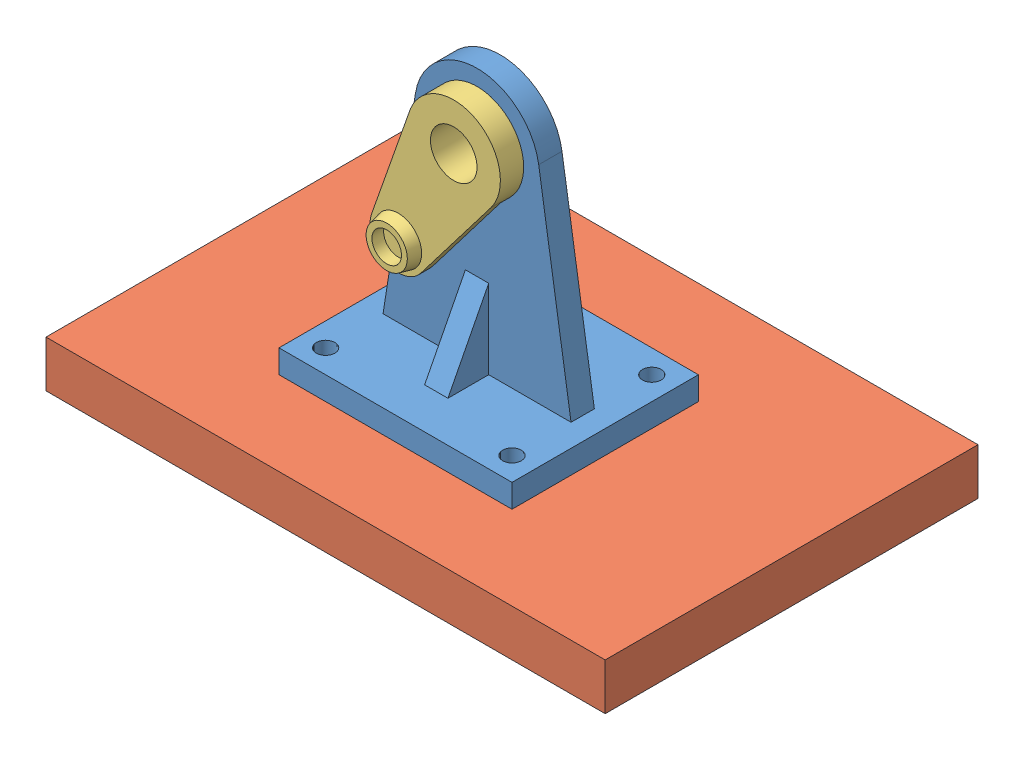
SolidWorks assembly Bill of Materials.SLDASM, configuration Default (file format 4052). Lengths in mm.
Overall size (152.4 90.01 101.6).
4 component instances, 3 part files, 2 mates.
Components (placement in the parent):
- Subassembly-1: Subassembly.sldasm [Default] at (-13.8841 20.0308 -6.2822) size (152.4 89.8 101.6)
  - Swing Bracket-1: Swing Bracket.SLDPRT [Default] at origin size (63.5 77.1 50.8)
  - Base Plate-1: Base Plate.SLDPRT [Default] at (-72.39 -12.7 -53.34) size (152.4 12.7 101.6)
- Swing Arm-1: Swing Arm.SLDPRT [Default] at (-13.8841 80.1325 -12.6322) x (0.879773 -0.475393 0) z (0 0 1) size (25.4 52.18 19.05)
Mates (geometry in assembly coordinates):
- Concentric4: concentric anti-aligned: cylinder of Subassembly-1/Swing Bracket-1 through (-13.8841 80.1325 -31.6822) axis (0 0 1) radius 7.9375; cylinder of Swing Arm-1 through (-13.8841 80.1325 -6.2822) axis (0 0 -1) radius 7.9375
- Coincident4: coincident anti-aligned: plane of Subassembly-1/Swing Bracket-1 through (-13.8841 80.1325 -6.2822) normal (0 0 1); plane of Swing Arm-1 through (-13.8841 80.1325 -6.2822) normal (0 0 -1)
